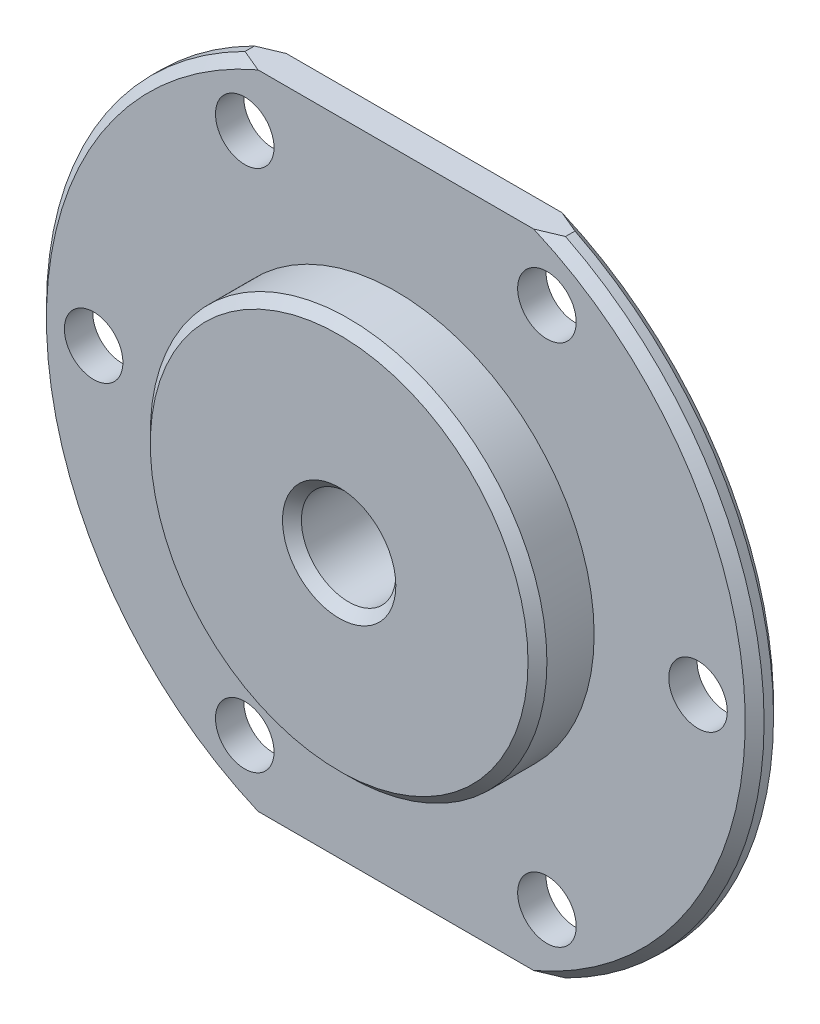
from build123d import *

# Parameters (mm, degrees)
BOSS_EXTRUDE1_DEPTH = 1.5
SKETCH3_R           = 10.5
BOSS_EXTRUDE2_DEPTH = 3
SKETCH4_R           = 2.5
CUT_EXTRUDE1_DEPTH  = 10
SKETCH5_R           = 5
SKETCH5_R_2         = 2.5
BOSS_EXTRUDE3_DEPTH = 5
SKETCH6_R           = 1.55
CUT_EXTRUDE2_DEPTH  = 5
CHAMFER1_SIZE       = 0.5
CHAMFER2_SIZE       = 0.5


with BuildPart() as part:
    # Sketch1 → Boss-Extrude1 (new body)
    with BuildSketch(Plane.XY):
        with BuildLine():
            Line((-8.485, 17), (8.485, 17))
            ThreePointArc((8.485, 17), (18.999874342, 0), (8.485, -17))
            Line((8.485, -17), (-8.485, -17))
            ThreePointArc((-8.485, -17), (-18.999874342, 0), (-8.485, 17))
        make_face()
    extrude(amount=BOSS_EXTRUDE1_DEPTH)

    # Sketch3 → Boss-Extrude2 (add)
    with BuildSketch(Plane.XY.offset(1.5)):
        Circle(SKETCH3_R)
    extrude(amount=BOSS_EXTRUDE2_DEPTH)

    # Sketch4 → Cut-Extrude1 (cut)
    with BuildSketch(Plane.XY.offset(4.5)):
        Circle(SKETCH4_R)
    extrude(amount=-CUT_EXTRUDE1_DEPTH, mode=Mode.SUBTRACT)

    # Sketch5 → Boss-Extrude3 (add)
    with BuildSketch(Plane(origin=(0, 0, 0), x_dir=(-1, 0, 0), z_dir=(0, 0, -1))):
        with Locations(Location((0, 0, 0), (0, 0, 180))):
            Circle(SKETCH5_R)
        with Locations(Location((0, 0, 0), (0, 0, 180))):
            Circle(SKETCH5_R_2, mode=Mode.SUBTRACT)
    extrude(amount=BOSS_EXTRUDE3_DEPTH)

    # Sketch6 → Cut-Extrude2 (cut)
    with BuildSketch(Plane.XY.offset(1.5)):
        with Locations((-16, 0)):
            Circle(SKETCH6_R)
        with Locations((-8, 13.856406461)):
            Circle(SKETCH6_R)
        with Locations((8, 13.856406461)):
            Circle(SKETCH6_R)
        with Locations((16, 0)):
            Circle(SKETCH6_R)
        with Locations((8, -13.856406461)):
            Circle(SKETCH6_R)
        with Locations((-8, -13.856406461)):
            Circle(SKETCH6_R)
    extrude(amount=-CUT_EXTRUDE2_DEPTH, mode=Mode.SUBTRACT)

    # Chamfer1
    chamfer1_edges = [part.edges().sort_by_distance(p)[0] for p in [
        (18.999874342, 0, 1.5),
        (-10.5, 0, 4.5),
        (-2.5, 0, 4.5),
        (-18.999874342, 0, 1.5),
        (18.999874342, 0, 0),
        (-18.999874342, 0, 0),
    ]]
    chamfer(chamfer1_edges, length=CHAMFER1_SIZE)

    # Chamfer2
    chamfer2_edges = [part.edges().sort_by_distance(p)[0] for p in [
        (-2.5, 0, -5),
        (-5, 0, -5),
    ]]
    chamfer(chamfer2_edges, length=CHAMFER2_SIZE)


solid = part.part
